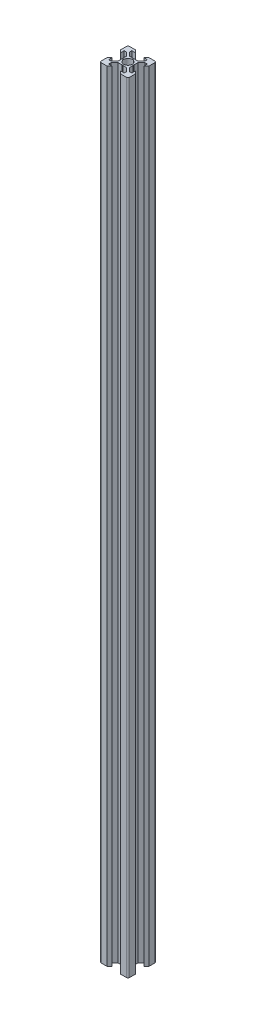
from build123d import *

# Parameters (mm, degrees)
SKETCH1_R           = 3
BOSS_EXTRUDE1_DEPTH = 552


with BuildPart() as part:
    # Sketch1 → Boss-Extrude1 (new body)
    with BuildSketch(Plane(origin=(0, 0, 0), x_dir=(1, 0, 0), z_dir=(0, 1, 0))):
        with BuildLine():
            Line((9.9996, -8.99964), (9.9996, -4.799808))
            Line((9.9996, -4.799808), (8.199672, -2.99988))
            Line((8.199672, -2.99988), (8.199672, -5.49978))
            Line((8.199672, -5.49978), (6.560397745, -5.49978))
            Line((6.560397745, -5.49978), (3.99984, -2.939222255))
            Line((3.99984, -2.939222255), (3.99984, -0.299988))
            Line((3.99984, -0.299988), (3.699852, 0))
            Line((3.699852, 0), (3.99984, 0.299988))
            Line((3.99984, 0.299988), (3.99984, 2.939222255))
            Line((3.99984, 2.939222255), (6.560397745, 5.49978))
            Line((6.560397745, 5.49978), (8.199672, 5.49978))
            Line((8.199672, 5.49978), (8.199672, 2.99988))
            Line((8.199672, 2.99988), (9.9996, 4.799808))
            Line((9.9996, 4.799808), (9.9996, 8.99964))
            ThreePointArc((9.9996, 8.99964), (9.706718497, 9.706718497), (8.99964, 9.9996))
            Line((8.99964, 9.9996), (4.799808, 9.9996))
            Line((4.799808, 9.9996), (2.99988, 8.199672))
            Line((2.99988, 8.199672), (5.49978, 8.199672))
            Line((5.49978, 8.199672), (5.49978, 6.560397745))
            Line((5.49978, 6.560397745), (2.939222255, 3.99984))
            Line((2.939222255, 3.99984), (0.299988, 3.99984))
            Line((0.299988, 3.99984), (0, 3.699852))
            Line((0, 3.699852), (-0.299988, 3.99984))
            Line((-0.299988, 3.99984), (-2.939222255, 3.99984))
            Line((-2.939222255, 3.99984), (-5.49978, 6.560397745))
            Line((-5.49978, 6.560397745), (-5.49978, 8.199672))
            Line((-5.49978, 8.199672), (-2.99988, 8.199672))
            Line((-2.99988, 8.199672), (-4.799808, 9.9996))
            Line((-4.799808, 9.9996), (-8.99964, 9.9996))
            ThreePointArc((-8.99964, 9.9996), (-9.706718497, 9.706718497), (-9.9996, 8.99964))
            Line((-9.9996, 8.99964), (-9.9996, 4.799808))
            Line((-9.9996, 4.799808), (-8.199672, 2.99988))
            Line((-8.199672, 2.99988), (-8.199672, 5.49978))
            Line((-8.199672, 5.49978), (-6.560397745, 5.49978))
            Line((-6.560397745, 5.49978), (-3.99984, 2.939222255))
            Line((-3.99984, 2.939222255), (-3.99984, 0.299988))
            Line((-3.99984, 0.299988), (-3.699852, 0))
            Line((-3.699852, 0), (-3.99984, -0.299988))
            Line((-3.99984, -0.299988), (-3.99984, -2.939222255))
            Line((-3.99984, -2.939222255), (-6.560397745, -5.49978))
            Line((-6.560397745, -5.49978), (-8.199672, -5.49978))
            Line((-8.199672, -5.49978), (-8.199672, -2.99988))
            Line((-8.199672, -2.99988), (-9.9996, -4.799808))
            Line((-9.9996, -4.799808), (-9.9996, -8.99964))
            ThreePointArc((-9.9996, -8.99964), (-9.706718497, -9.706718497), (-8.99964, -9.9996))
            Line((-8.99964, -9.9996), (-4.799808, -9.9996))
            Line((-4.799808, -9.9996), (-2.99988, -8.199672))
            Line((-2.99988, -8.199672), (-5.49978, -8.199672))
            Line((-5.49978, -8.199672), (-5.49978, -6.560397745))
            Line((-5.49978, -6.560397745), (-2.939222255, -3.99984))
            Line((-2.939222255, -3.99984), (-0.299988, -3.99984))
            Line((-0.299988, -3.99984), (0, -3.699852))
            Line((0, -3.699852), (0.299988, -3.99984))
            Line((0.299988, -3.99984), (2.939222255, -3.99984))
            Line((2.939222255, -3.99984), (5.49978, -6.560397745))
            Line((5.49978, -6.560397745), (5.49978, -8.199672))
            Line((5.49978, -8.199672), (2.99988, -8.199672))
            Line((2.99988, -8.199672), (4.799808, -9.9996))
            Line((4.799808, -9.9996), (8.99964, -9.9996))
            ThreePointArc((8.99964, -9.9996), (9.706718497, -9.706718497), (9.9996, -8.99964))
        make_face()
        with Locations(Location((0, 0, 0), (0, 0, 270))):
            Circle(SKETCH1_R, mode=Mode.SUBTRACT)
    extrude(amount=BOSS_EXTRUDE1_DEPTH)


solid = part.part
